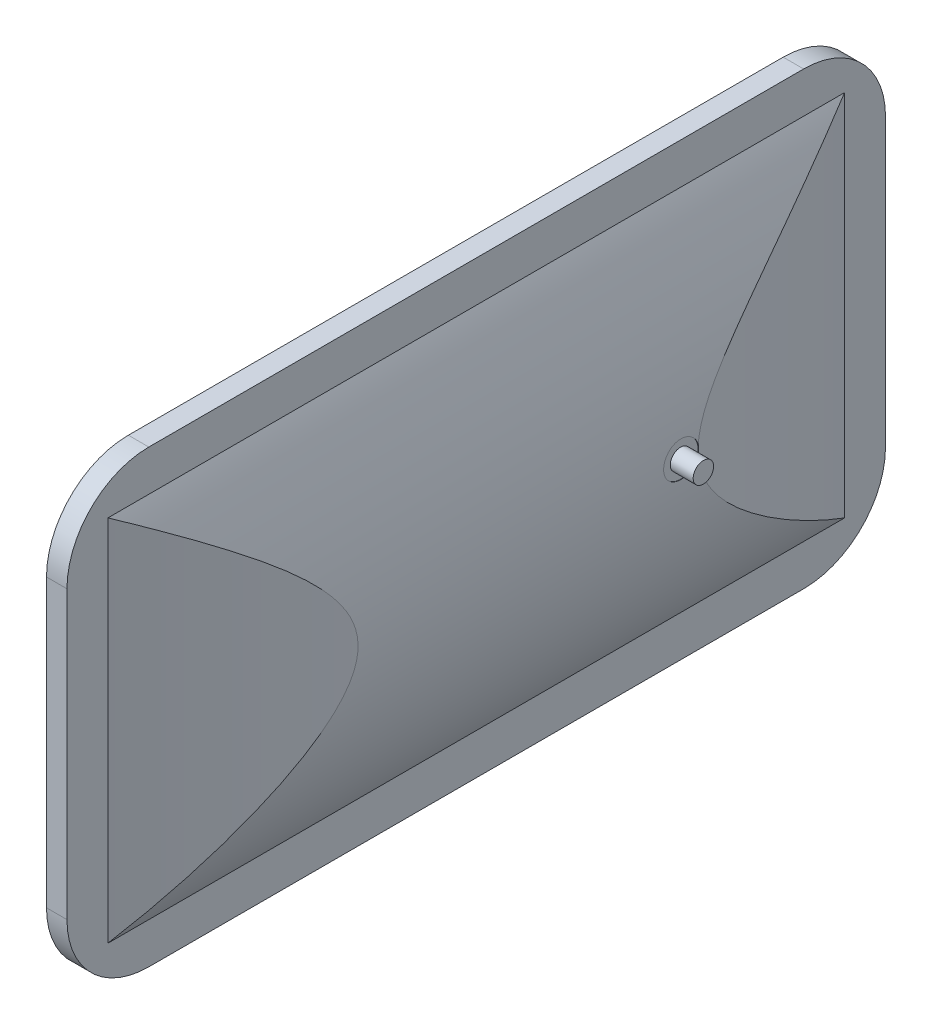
from build123d import *

# Parameters (mm, degrees)
BASE_EXTRUDE_DEPTH  = 254
SKETCH2_OUTSIDE_W   = 99.046
SKETCH2_OUTSIDE_H   = 314.488
CUT_EXTRUDE1_DEPTH  = 291.5232663
CUT_EXTRUDE2_REACH  = 292.751
SKETCH3_R           = 5.461
FILLET1_R           = 25.4
SKETCH4_R           = 5.461
BOSS_EXTRUDE1_DEPTH = 19.05
SKETCH5_R           = 3.175
BOSS_EXTRUDE2_DEPTH = 7.112


with BuildPart() as part:
    # Sketch1 → Base-Extrude (new body)
    with BuildSketch(Plane.XY):
        with BuildLine():
            Line((-3.175, 0), (-3.175, 12.7))
            ThreePointArc((-3.175, 12.7), (-19.278959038, 69.85), (-3.175, 127))
            Line((-3.175, 127), (-3.175, 139.7))
            Line((-3.175, 139.7), (3.175, 139.7))
            Line((3.175, 139.7), (3.175, 127))
            ThreePointArc((3.175, 127), (19.278959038, 69.85), (3.175, 12.7))
            Line((3.175, 12.7), (3.175, 0))
            Line((3.175, 0), (-3.175, 0))
        make_face()
    extrude(amount=BASE_EXTRUDE_DEPTH)

    # Sketch2 outside → Cut-Extrude1 (cut, through all)
    with BuildSketch(Plane(origin=(0, 139.7, 0), x_dir=(-1, 0, 0), z_dir=(0, 1, 0))):
        with Locations((0, 127)):
            Rectangle(SKETCH2_OUTSIDE_W, SKETCH2_OUTSIDE_H)
        with BuildLine():
            Line((3.175, 0), (-3.175, 0))
            Line((-3.175, 0), (-3.175, 12.7))
            ThreePointArc((-3.175, 12.7), (-23.506154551, 127), (-3.175, 241.3))
            Line((-3.175, 241.3), (-3.175, 254))
            Line((-3.175, 254), (3.175, 254))
            Line((3.175, 254), (3.175, 241.3))
            ThreePointArc((3.175, 241.3), (23.506154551, 127), (3.175, 12.7))
            Line((3.175, 12.7), (3.175, 0))
        make_face(mode=Mode.SUBTRACT)
    extrude(amount=-CUT_EXTRUDE1_DEPTH, mode=Mode.SUBTRACT)

    # Sketch3 → Cut-Extrude2 (cut, up to next)
    with BuildSketch(Plane(origin=(3.175, 0, 0), x_dir=(0, 0, -1), z_dir=(1, 0, 0)), mode=Mode.PRIVATE) as cut_extrude2_sk1:
        with Locations(Location((-79.497249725, 69.85, 0), (0, 0, 346.521709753))):
            Circle(SKETCH3_R)
    cut_extrude2_tool1 = extrude(cut_extrude2_sk1.sketch, amount=CUT_EXTRUDE2_REACH, mode=Mode.PRIVATE) & part.part
    add(cut_extrude2_tool1.solids().sort_by_distance((3.175, 69.85, 79.49725))[0], mode=Mode.SUBTRACT)

    # Fillet1
    fillet1_edges = [part.edges().sort_by_distance(p)[0] for p in [
        (0, 139.7, 0),
        (0, 0, 0),
        (0, 139.7, 254),
        (0, 0, 254),
    ]]
    fillet(fillet1_edges, radius=FILLET1_R)

    # Sketch4 → Boss-Extrude1 (add)
    with BuildSketch(Plane(origin=(0, 0, 0), x_dir=(0, 0, -1), z_dir=(1, 0, 0))):
        with Locations(Location((-79.497249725, 69.85, 0), (0, 0, 346.521709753))):
            Circle(SKETCH4_R)
    extrude(amount=BOSS_EXTRUDE1_DEPTH)

    # Sketch5 → Boss-Extrude2 (add)
    with BuildSketch(Plane(origin=(19.05, 0, 0), x_dir=(0, 0, -1), z_dir=(1, 0, 0))):
        with Locations((-79.497249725, 69.85)):
            Circle(SKETCH5_R)
    extrude(amount=BOSS_EXTRUDE2_DEPTH)


solid = part.part
